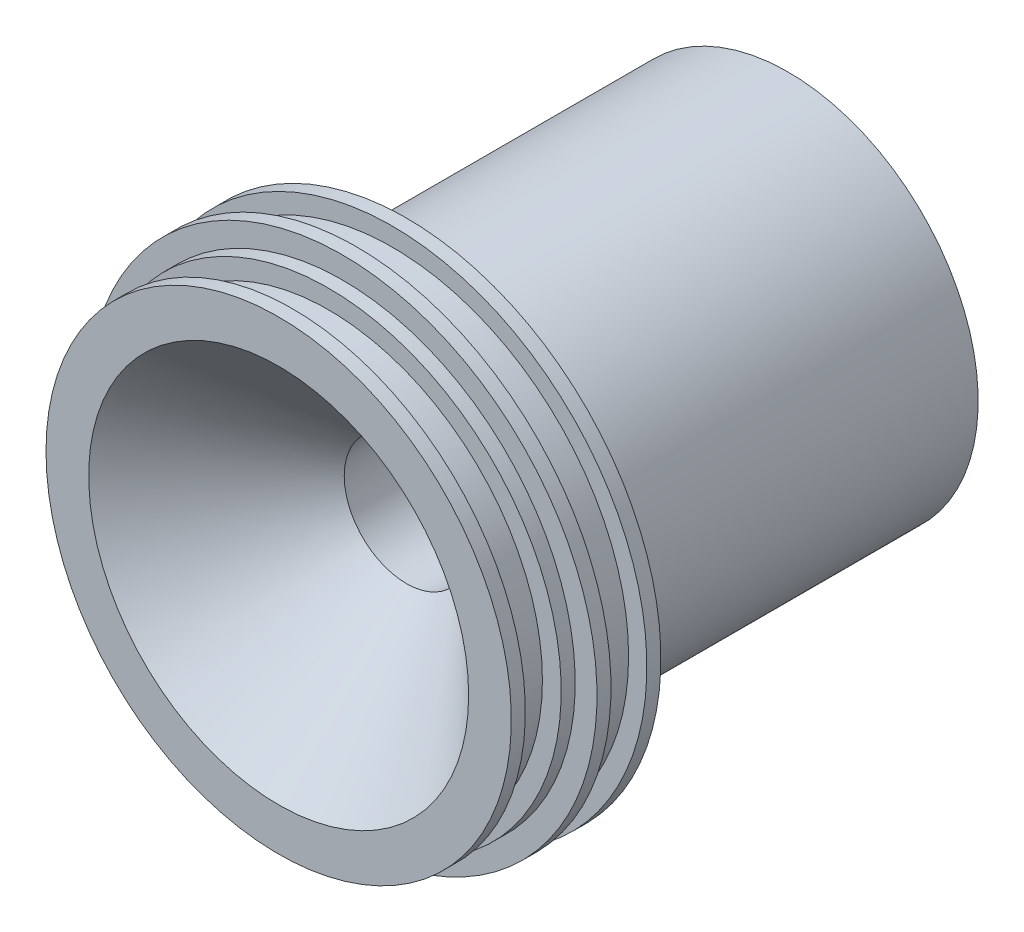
from build123d import *


with BuildPart() as part:
    # Sketch1 → Revolve1 (revolve)
    with BuildSketch(Plane.YZ, mode=Mode.PRIVATE) as revolve1_sk:
        Polygon((9.253474, 7.26694), (28.2575, 26.270966), (34.6075, 26.270966), (34.6075, 24.1869595), (31.8135, 24.1869595), (31.8135, 18.8529595), (34.6075, 18.8529595), (34.6075, 16.768953), (37.846, 16.768953), (37.846, 14.6849465), (35.1282, 14.6849465), (35.1282, 9.3509465), (37.846, 9.3509465), (37.846, 7.26694), (28.2575, 7.26694), (28.2575, -49.5157182), (20.574, -49.5157182), (9.253474, -7.26694), align=None)
    revolve(revolve1_sk.sketch.rotate(Axis((0, 0, -87.464922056), (0, 0, 1)), 90), axis=Axis((0, 0, -87.464922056), (0, 0, 1)))


solid = part.part
